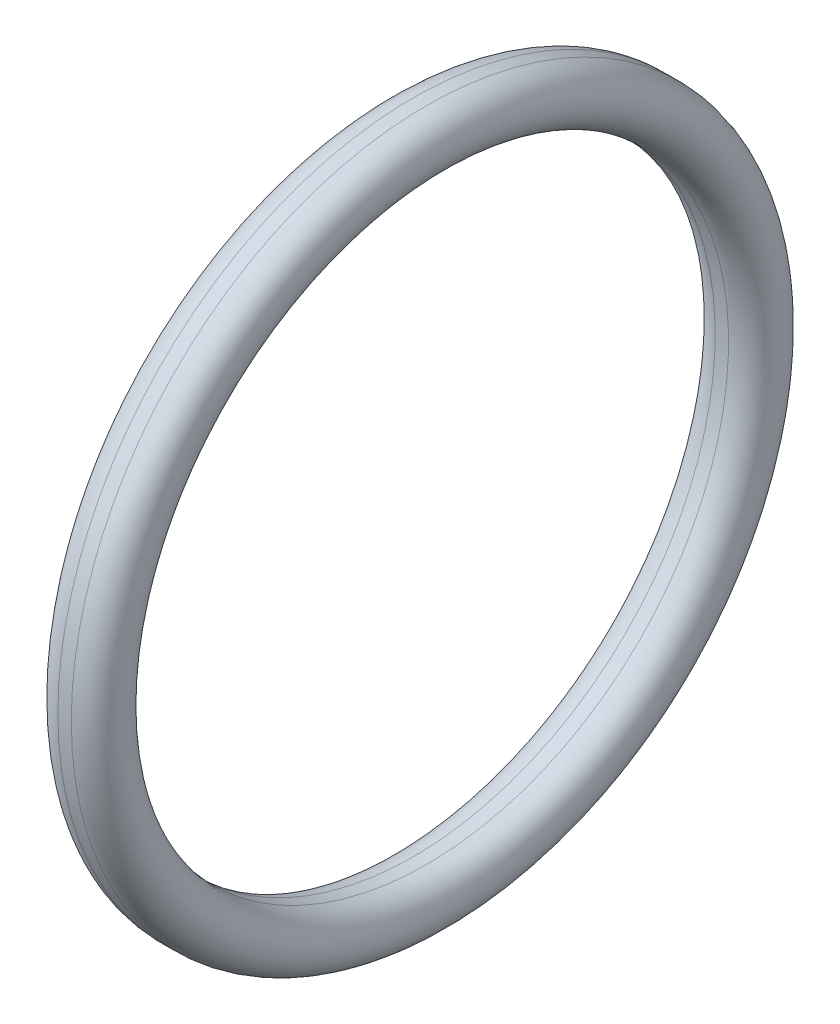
from build123d import *


with BuildPart() as part:
    # Sketch1 → Revolve1 (revolve)
    with BuildSketch(Plane.XY, mode=Mode.PRIVATE) as revolve1_sk:
        with BuildLine():
            Line((-0.254, 13.4874), (0.254, 13.4874))
            ThreePointArc((0.254, 13.4874), (1.27, 12.4714), (0.254, 11.4554))
            Line((0.254, 11.4554), (-0.254, 11.4554))
            ThreePointArc((-0.254, 11.4554), (-1.27, 12.4714), (-0.254, 13.4874))
        make_face()
    revolve(revolve1_sk.sketch.rotate(Axis((0, 0, 0), (1, 0, 0)), 90), axis=Axis((0, 0, 0), (1, 0, 0)))


solid = part.part
